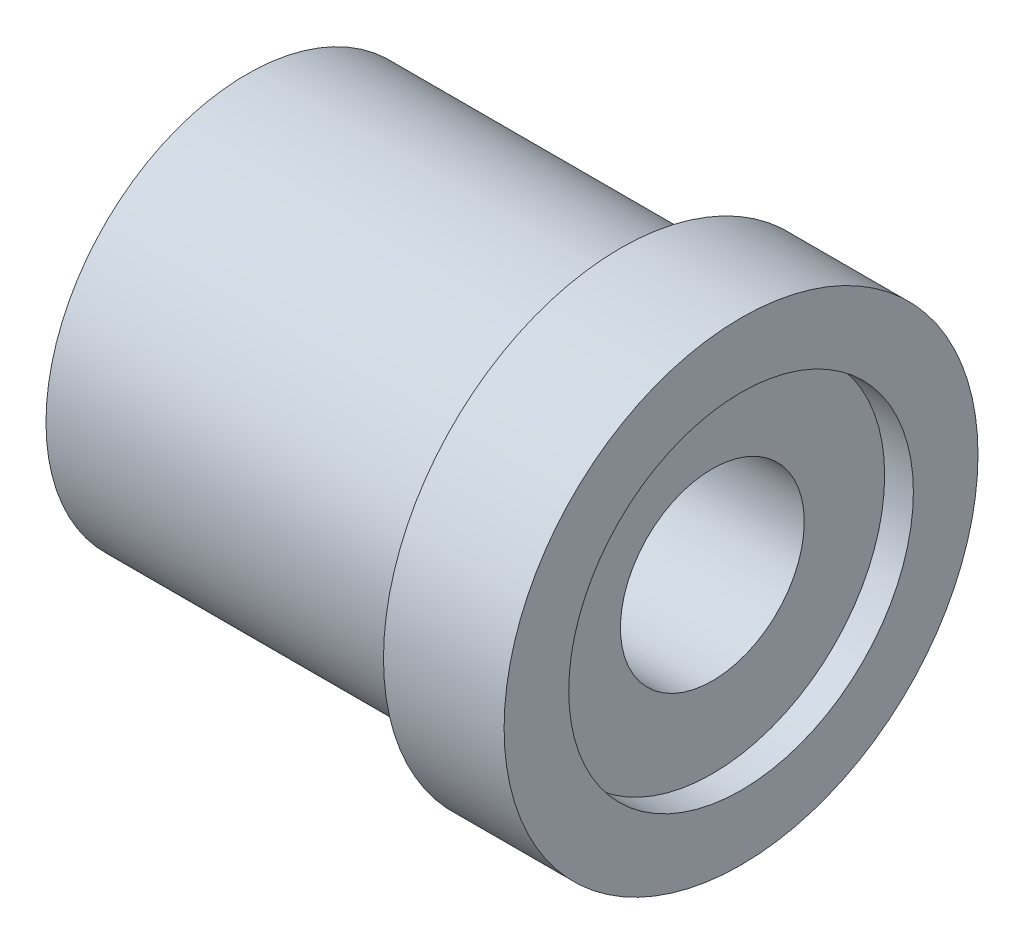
ISO-10303-21;
HEADER;
FILE_DESCRIPTION(('STEP AP214'),'2;1');
FILE_NAME('part.step','',(''),(''),'','','');
FILE_SCHEMA(('AUTOMOTIVE_DESIGN { 1 0 10303 214 1 1 1 1 }'));
ENDSEC;
DATA;
#1=APPLICATION_CONTEXT('core data for automotive mechanical design processes');
#2=APPLICATION_PROTOCOL_DEFINITION('international standard','automotive_design',2000,#1);
#3=PRODUCT_CONTEXT('',#1,'mechanical');
#4=PRODUCT('Part','Part','',(#3));
#5=PRODUCT_RELATED_PRODUCT_CATEGORY('part','',(#4));
#6=PRODUCT_DEFINITION_FORMATION('','',#4);
#7=PRODUCT_DEFINITION_CONTEXT('part definition',#1,'design');
#8=PRODUCT_DEFINITION('design','',#6,#7);
#9=PRODUCT_DEFINITION_SHAPE('','',#8);
#10=(LENGTH_UNIT() NAMED_UNIT(*) SI_UNIT(.MILLI.,.METRE.));
#11=(NAMED_UNIT(*) PLANE_ANGLE_UNIT() SI_UNIT($,.RADIAN.));
#12=(NAMED_UNIT(*) SI_UNIT($,.STERADIAN.) SOLID_ANGLE_UNIT());
#13=UNCERTAINTY_MEASURE_WITH_UNIT(LENGTH_MEASURE(1.E-05),#10,'distance_accuracy_value','');
#14=(GEOMETRIC_REPRESENTATION_CONTEXT(3) GLOBAL_UNCERTAINTY_ASSIGNED_CONTEXT((#13)) GLOBAL_UNIT_ASSIGNED_CONTEXT((#10,
#11,#12)) REPRESENTATION_CONTEXT('',''));
#15=CARTESIAN_POINT('',(0.,0.,0.));
#16=DIRECTION('',(0.,0.,1.));
#17=DIRECTION('',(1.,0.,0.));
#18=AXIS2_PLACEMENT_3D('',#15,#16,#17);
#19=CARTESIAN_POINT('',(-8.6,0.,0.));
#20=DIRECTION('',(1.,0.,0.));
#21=DIRECTION('',(0.,0.,-1.));
#22=AXIS2_PLACEMENT_3D('',#19,#20,#21);
#23=CYLINDRICAL_SURFACE('',#22,3.);
#24=CARTESIAN_POINT('',(2.6,0.,0.));
#25=DIRECTION('',(1.,0.,0.));
#26=DIRECTION('',(0.,0.,-1.));
#27=AXIS2_PLACEMENT_3D('',#24,#25,#26);
#28=CIRCLE('',#27,3.);
#29=CARTESIAN_POINT('',(2.6,0.,-3.));
#30=VERTEX_POINT('',#29);
#31=EDGE_CURVE('P0_E16',#30,#30,#28,.F.);
#32=ORIENTED_EDGE('',*,*,#31,.T.);
#33=EDGE_LOOP('',(#32));
#34=FACE_BOUND('',#33,.T.);
#35=CARTESIAN_POINT('',(-8.6,0.,0.));
#36=DIRECTION('',(1.,0.,0.));
#37=DIRECTION('',(0.,0.,-1.));
#38=AXIS2_PLACEMENT_3D('',#35,#36,#37);
#39=CIRCLE('',#38,3.);
#40=CARTESIAN_POINT('',(-8.6,0.,-3.));
#41=VERTEX_POINT('',#40);
#42=EDGE_CURVE('P0_E10',#41,#41,#39,.T.);
#43=ORIENTED_EDGE('',*,*,#42,.T.);
#44=EDGE_LOOP('',(#43));
#45=FACE_BOUND('',#44,.T.);
#46=ADVANCED_FACE('P0_F15',(#34,#45),#23,.T.);
#47=OPEN_SHELL('',(#46));
#48=SHELL_BASED_SURFACE_MODEL('P0_B1',(#47));
#49=CARTESIAN_POINT('',(7.6,0.,0.));
#50=DIRECTION('',(1.,0.,0.));
#51=DIRECTION('',(0.,0.,-1.));
#52=AXIS2_PLACEMENT_3D('',#49,#50,#51);
#53=PLANE('',#52);
#54=CARTESIAN_POINT('',(7.6,0.,0.));
#55=DIRECTION('',(1.,0.,0.));
#56=DIRECTION('',(0.,0.,-1.));
#57=AXIS2_PLACEMENT_3D('',#54,#55,#56);
#58=CIRCLE('',#57,3.2);
#59=CARTESIAN_POINT('',(7.6,0.,-3.2));
#60=VERTEX_POINT('',#59);
#61=EDGE_CURVE('P1_E18',#60,#60,#58,.F.);
#62=ORIENTED_EDGE('',*,*,#61,.T.);
#63=EDGE_LOOP('',(#62));
#64=FACE_BOUND('',#63,.T.);
#65=CARTESIAN_POINT('',(7.6,0.,0.));
#66=DIRECTION('',(1.,0.,0.));
#67=DIRECTION('',(0.,0.,-1.));
#68=AXIS2_PLACEMENT_3D('',#65,#66,#67);
#69=CIRCLE('',#68,6.);
#70=CARTESIAN_POINT('',(7.6,0.,-6.));
#71=VERTEX_POINT('',#70);
#72=EDGE_CURVE('P1_E46',#71,#71,#69,.T.);
#73=ORIENTED_EDGE('',*,*,#72,.T.);
#74=EDGE_LOOP('',(#73));
#75=FACE_BOUND('',#74,.T.);
#76=ADVANCED_FACE('P1_F15',(#64,#75),#53,.T.);
#77=CARTESIAN_POINT('',(-9.46,0.,0.));
#78=DIRECTION('',(1.,0.,0.));
#79=DIRECTION('',(0.,0.,-1.));
#80=AXIS2_PLACEMENT_3D('',#77,#78,#79);
#81=CYLINDRICAL_SURFACE('',#80,3.2);
#82=CARTESIAN_POINT('',(2.6,0.,0.));
#83=DIRECTION('',(1.,0.,0.));
#84=DIRECTION('',(0.,0.,-1.));
#85=AXIS2_PLACEMENT_3D('',#82,#83,#84);
#86=CIRCLE('',#85,3.2);
#87=CARTESIAN_POINT('',(2.6,0.,-3.2));
#88=VERTEX_POINT('',#87);
#89=EDGE_CURVE('P1_E44',#88,#88,#86,.T.);
#90=ORIENTED_EDGE('',*,*,#89,.F.);
#91=EDGE_LOOP('',(#90));
#92=FACE_BOUND('',#91,.T.);
#93=ORIENTED_EDGE('',*,*,#61,.F.);
#94=EDGE_LOOP('',(#93));
#95=FACE_BOUND('',#94,.T.);
#96=ADVANCED_FACE('P1_F54',(#92,#95),#81,.F.);
#97=CARTESIAN_POINT('',(-9.46,0.,0.));
#98=DIRECTION('',(1.,0.,0.));
#99=DIRECTION('',(0.,0.,-1.));
#100=AXIS2_PLACEMENT_3D('',#97,#98,#99);
#101=CYLINDRICAL_SURFACE('',#100,6.);
#102=CARTESIAN_POINT('',(8.6,0.,0.));
#103=DIRECTION('',(1.,0.,0.));
#104=DIRECTION('',(0.,0.,-1.));
#105=AXIS2_PLACEMENT_3D('',#102,#103,#104);
#106=CIRCLE('',#105,6.);
#107=CARTESIAN_POINT('',(8.6,0.,-6.));
#108=VERTEX_POINT('',#107);
#109=EDGE_CURVE('P1_E41',#108,#108,#106,.F.);
#110=ORIENTED_EDGE('',*,*,#109,.F.);
#111=EDGE_LOOP('',(#110));
#112=FACE_BOUND('',#111,.T.);
#113=ORIENTED_EDGE('',*,*,#72,.F.);
#114=EDGE_LOOP('',(#113));
#115=FACE_BOUND('',#114,.T.);
#116=ADVANCED_FACE('P1_F56',(#112,#115),#101,.F.);
#117=CARTESIAN_POINT('',(2.6,0.,0.));
#118=DIRECTION('',(1.,0.,0.));
#119=DIRECTION('',(0.,0.,-1.));
#120=AXIS2_PLACEMENT_3D('',#117,#118,#119);
#121=PLANE('',#120);
#122=CARTESIAN_POINT('',(2.6,0.,0.));
#123=DIRECTION('',(1.,0.,0.));
#124=DIRECTION('',(0.,0.,-1.));
#125=AXIS2_PLACEMENT_3D('',#122,#123,#124);
#126=CIRCLE('',#125,2.55);
#127=CARTESIAN_POINT('',(2.6,0.,-2.55));
#128=VERTEX_POINT('',#127);
#129=EDGE_CURVE('P1_E38',#128,#128,#126,.F.);
#130=ORIENTED_EDGE('',*,*,#129,.T.);
#131=EDGE_LOOP('',(#130));
#132=FACE_BOUND('',#131,.T.);
#133=ORIENTED_EDGE('',*,*,#89,.T.);
#134=EDGE_LOOP('',(#133));
#135=FACE_BOUND('',#134,.T.);
#136=ADVANCED_FACE('P1_F63',(#132,#135),#121,.T.);
#137=CARTESIAN_POINT('',(8.6,0.,0.));
#138=DIRECTION('',(1.,0.,0.));
#139=DIRECTION('',(0.,0.,-1.));
#140=AXIS2_PLACEMENT_3D('',#137,#138,#139);
#141=PLANE('',#140);
#142=ORIENTED_EDGE('',*,*,#109,.T.);
#143=EDGE_LOOP('',(#142));
#144=FACE_BOUND('',#143,.T.);
#145=CARTESIAN_POINT('',(8.6,0.,0.));
#146=DIRECTION('',(1.,0.,0.));
#147=DIRECTION('',(0.,0.,-1.));
#148=AXIS2_PLACEMENT_3D('',#145,#146,#147);
#149=CIRCLE('',#148,8.25);
#150=CARTESIAN_POINT('',(8.6,0.,-8.25));
#151=VERTEX_POINT('',#150);
#152=EDGE_CURVE('P1_E35',#151,#151,#149,.F.);
#153=ORIENTED_EDGE('',*,*,#152,.F.);
#154=EDGE_LOOP('',(#153));
#155=FACE_BOUND('',#154,.T.);
#156=ADVANCED_FACE('P1_F89',(#144,#155),#141,.T.);
#157=CARTESIAN_POINT('',(-9.46,0.,0.));
#158=DIRECTION('',(1.,0.,0.));
#159=DIRECTION('',(0.,0.,-1.));
#160=AXIS2_PLACEMENT_3D('',#157,#158,#159);
#161=CYLINDRICAL_SURFACE('',#160,2.55);
#162=ORIENTED_EDGE('',*,*,#129,.F.);
#163=EDGE_LOOP('',(#162));
#164=FACE_BOUND('',#163,.T.);
#165=CARTESIAN_POINT('',(-8.6,0.,0.));
#166=DIRECTION('',(1.,0.,0.));
#167=DIRECTION('',(0.,0.,-1.));
#168=AXIS2_PLACEMENT_3D('',#165,#166,#167);
#169=CIRCLE('',#168,2.55);
#170=CARTESIAN_POINT('',(-8.6,0.,-2.55));
#171=VERTEX_POINT('',#170);
#172=EDGE_CURVE('P1_E32',#171,#171,#169,.F.);
#173=ORIENTED_EDGE('',*,*,#172,.T.);
#174=EDGE_LOOP('',(#173));
#175=FACE_BOUND('',#174,.T.);
#176=ADVANCED_FACE('P1_F85',(#164,#175),#161,.F.);
#177=CARTESIAN_POINT('',(-9.46,0.,0.));
#178=DIRECTION('',(1.,0.,0.));
#179=DIRECTION('',(0.,0.,-1.));
#180=AXIS2_PLACEMENT_3D('',#177,#178,#179);
#181=CYLINDRICAL_SURFACE('',#180,8.25);
#182=ORIENTED_EDGE('',*,*,#152,.T.);
#183=EDGE_LOOP('',(#182));
#184=FACE_BOUND('',#183,.T.);
#185=CARTESIAN_POINT('',(4.4,0.,0.));
#186=DIRECTION('',(1.,0.,0.));
#187=DIRECTION('',(0.,0.,-1.));
#188=AXIS2_PLACEMENT_3D('',#185,#186,#187);
#189=CIRCLE('',#188,8.25);
#190=CARTESIAN_POINT('',(4.4,0.,-8.25));
#191=VERTEX_POINT('',#190);
#192=EDGE_CURVE('P1_E27',#191,#191,#189,.T.);
#193=ORIENTED_EDGE('',*,*,#192,.T.);
#194=EDGE_LOOP('',(#193));
#195=FACE_BOUND('',#194,.T.);
#196=ADVANCED_FACE('P1_F81',(#184,#195),#181,.T.);
#197=CARTESIAN_POINT('',(-8.6,0.,0.));
#198=DIRECTION('',(1.,0.,0.));
#199=DIRECTION('',(0.,0.,-1.));
#200=AXIS2_PLACEMENT_3D('',#197,#198,#199);
#201=PLANE('',#200);
#202=ORIENTED_EDGE('',*,*,#172,.F.);
#203=EDGE_LOOP('',(#202));
#204=FACE_BOUND('',#203,.T.);
#205=CARTESIAN_POINT('',(-8.6,0.,0.));
#206=DIRECTION('',(1.,0.,0.));
#207=DIRECTION('',(0.,0.,-1.));
#208=AXIS2_PLACEMENT_3D('',#205,#206,#207);
#209=CIRCLE('',#208,7.);
#210=CARTESIAN_POINT('',(-8.6,0.,-7.));
#211=VERTEX_POINT('',#210);
#212=EDGE_CURVE('P1_E22',#211,#211,#209,.T.);
#213=ORIENTED_EDGE('',*,*,#212,.F.);
#214=EDGE_LOOP('',(#213));
#215=FACE_BOUND('',#214,.T.);
#216=ADVANCED_FACE('P1_F74',(#204,#215),#201,.F.);
#217=CARTESIAN_POINT('',(4.4,0.,0.));
#218=DIRECTION('',(1.,0.,0.));
#219=DIRECTION('',(0.,0.,-1.));
#220=AXIS2_PLACEMENT_3D('',#217,#218,#219);
#221=PLANE('',#220);
#222=CARTESIAN_POINT('',(4.4,0.,0.));
#223=DIRECTION('',(1.,0.,0.));
#224=DIRECTION('',(0.,0.,-1.));
#225=AXIS2_PLACEMENT_3D('',#222,#223,#224);
#226=CIRCLE('',#225,7.);
#227=CARTESIAN_POINT('',(4.4,0.,-7.));
#228=VERTEX_POINT('',#227);
#229=EDGE_CURVE('P1_E10',#228,#228,#226,.F.);
#230=ORIENTED_EDGE('',*,*,#229,.F.);
#231=EDGE_LOOP('',(#230));
#232=FACE_BOUND('',#231,.T.);
#233=ORIENTED_EDGE('',*,*,#192,.F.);
#234=EDGE_LOOP('',(#233));
#235=FACE_BOUND('',#234,.T.);
#236=ADVANCED_FACE('P1_F69',(#232,#235),#221,.F.);
#237=CARTESIAN_POINT('',(-9.46,0.,0.));
#238=DIRECTION('',(1.,0.,0.));
#239=DIRECTION('',(0.,0.,-1.));
#240=AXIS2_PLACEMENT_3D('',#237,#238,#239);
#241=CYLINDRICAL_SURFACE('',#240,7.);
#242=ORIENTED_EDGE('',*,*,#229,.T.);
#243=EDGE_LOOP('',(#242));
#244=FACE_BOUND('',#243,.T.);
#245=ORIENTED_EDGE('',*,*,#212,.T.);
#246=EDGE_LOOP('',(#245));
#247=FACE_BOUND('',#246,.T.);
#248=ADVANCED_FACE('P1_F67',(#244,#247),#241,.T.);
#249=CLOSED_SHELL('',(#76,#96,#116,#136,#156,#176,#196,#216,#236,#248));
#250=MANIFOLD_SOLID_BREP('P1_B1',#249);
#251=ADVANCED_BREP_SHAPE_REPRESENTATION('',(#18,#250),#14);
#252=MANIFOLD_SURFACE_SHAPE_REPRESENTATION('',(#18,#48),#14);
#253=SHAPE_REPRESENTATION('',(#18),#14);
#254=SHAPE_DEFINITION_REPRESENTATION(#9,#253);
#255=SHAPE_REPRESENTATION_RELATIONSHIP('','',#253,#251);
#256=SHAPE_REPRESENTATION_RELATIONSHIP('','',#253,#252);
ENDSEC;
END-ISO-10303-21;
